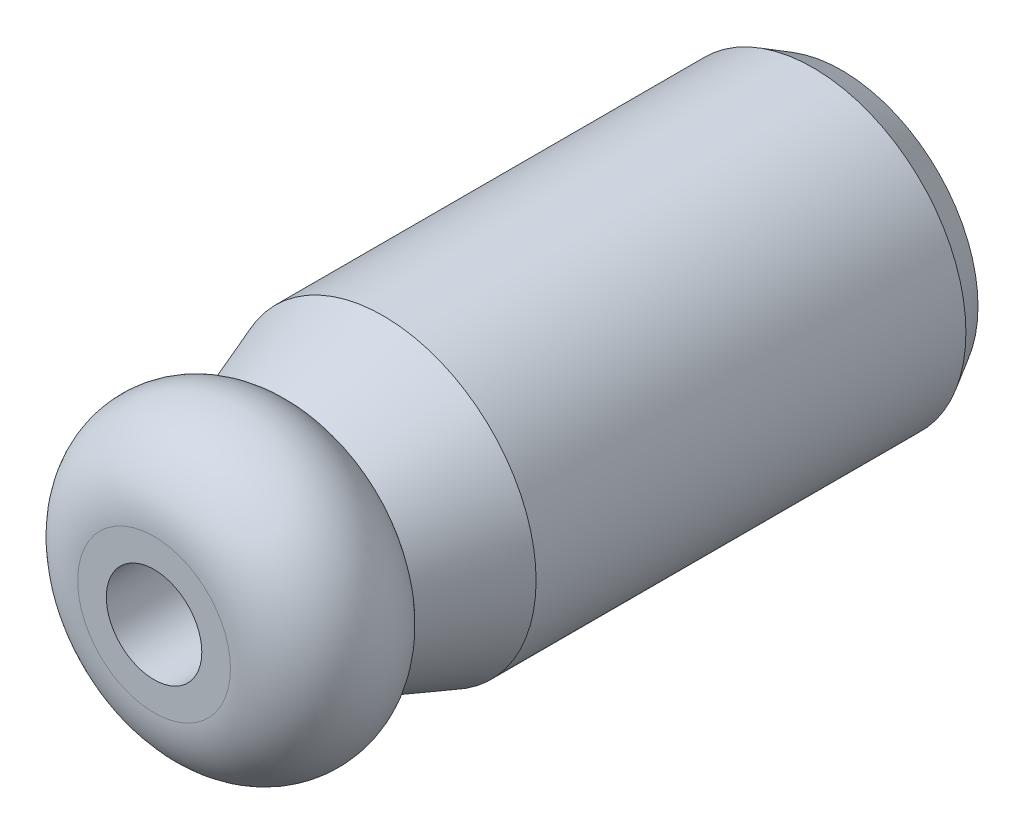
ISO-10303-21;
HEADER;
FILE_DESCRIPTION(('STEP AP214'),'2;1');
FILE_NAME('part.step','',(''),(''),'','','');
FILE_SCHEMA(('AUTOMOTIVE_DESIGN { 1 0 10303 214 1 1 1 1 }'));
ENDSEC;
DATA;
#1=APPLICATION_CONTEXT('core data for automotive mechanical design processes');
#2=APPLICATION_PROTOCOL_DEFINITION('international standard','automotive_design',2000,#1);
#3=PRODUCT_CONTEXT('',#1,'mechanical');
#4=PRODUCT('Part','Part','',(#3));
#5=PRODUCT_RELATED_PRODUCT_CATEGORY('part','',(#4));
#6=PRODUCT_DEFINITION_FORMATION('','',#4);
#7=PRODUCT_DEFINITION_CONTEXT('part definition',#1,'design');
#8=PRODUCT_DEFINITION('design','',#6,#7);
#9=PRODUCT_DEFINITION_SHAPE('','',#8);
#10=(LENGTH_UNIT() NAMED_UNIT(*) SI_UNIT(.MILLI.,.METRE.));
#11=(NAMED_UNIT(*) PLANE_ANGLE_UNIT() SI_UNIT($,.RADIAN.));
#12=(NAMED_UNIT(*) SI_UNIT($,.STERADIAN.) SOLID_ANGLE_UNIT());
#13=UNCERTAINTY_MEASURE_WITH_UNIT(LENGTH_MEASURE(1.E-05),#10,'distance_accuracy_value','');
#14=(GEOMETRIC_REPRESENTATION_CONTEXT(3) GLOBAL_UNCERTAINTY_ASSIGNED_CONTEXT((#13)) GLOBAL_UNIT_ASSIGNED_CONTEXT((#10,
#11,#12)) REPRESENTATION_CONTEXT('',''));
#15=CARTESIAN_POINT('',(0.,0.,0.));
#16=DIRECTION('',(0.,0.,1.));
#17=DIRECTION('',(1.,0.,0.));
#18=AXIS2_PLACEMENT_3D('',#15,#16,#17);
#19=CARTESIAN_POINT('',(0.,2.5,26.));
#20=DIRECTION('',(0.,0.,1.));
#21=DIRECTION('',(1.,0.,0.));
#22=AXIS2_PLACEMENT_3D('',#19,#20,#21);
#23=PLANE('',#22);
#24=CARTESIAN_POINT('',(0.,0.,26.));
#25=DIRECTION('',(0.,0.,1.));
#26=DIRECTION('',(1.,0.,0.));
#27=AXIS2_PLACEMENT_3D('',#24,#25,#26);
#28=CIRCLE('',#27,2.5);
#29=CARTESIAN_POINT('',(2.5,0.,26.));
#30=VERTEX_POINT('',#29);
#31=EDGE_CURVE('E8',#30,#30,#28,.T.);
#32=ORIENTED_EDGE('',*,*,#31,.T.);
#33=EDGE_LOOP('',(#32));
#34=FACE_BOUND('',#33,.T.);
#35=ADVANCED_FACE('F12',(#34),#23,.T.);
#36=CARTESIAN_POINT('',(0.,0.,41.6972645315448));
#37=DIRECTION('',(0.,0.,1.));
#38=DIRECTION('',(1.,0.,0.));
#39=AXIS2_PLACEMENT_3D('',#36,#37,#38);
#40=CYLINDRICAL_SURFACE('',#39,2.5);
#41=CARTESIAN_POINT('',(0.,0.,36.));
#42=DIRECTION('',(0.,0.,1.));
#43=DIRECTION('',(1.,0.,0.));
#44=AXIS2_PLACEMENT_3D('',#41,#42,#43);
#45=CIRCLE('',#44,2.5);
#46=CARTESIAN_POINT('',(2.5,0.,36.));
#47=VERTEX_POINT('',#46);
#48=EDGE_CURVE('E18',#47,#47,#45,.T.);
#49=ORIENTED_EDGE('',*,*,#48,.T.);
#50=EDGE_LOOP('',(#49));
#51=FACE_BOUND('',#50,.T.);
#52=ORIENTED_EDGE('',*,*,#31,.F.);
#53=EDGE_LOOP('',(#52));
#54=FACE_BOUND('',#53,.T.);
#55=ADVANCED_FACE('F54',(#51,#54),#40,.F.);
#56=CARTESIAN_POINT('',(0.,4.,35.999999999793));
#57=DIRECTION('',(0.,0.,1.));
#58=DIRECTION('',(1.,0.,0.));
#59=AXIS2_PLACEMENT_3D('',#56,#57,#58);
#60=PLANE('',#59);
#61=CARTESIAN_POINT('',(0.,0.,35.9999999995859));
#62=DIRECTION('',(0.,0.,1.));
#63=DIRECTION('',(1.,0.,0.));
#64=AXIS2_PLACEMENT_3D('',#61,#62,#63);
#65=CIRCLE('',#64,4.);
#66=CARTESIAN_POINT('',(4.,0.,35.9999999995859));
#67=VERTEX_POINT('',#66);
#68=EDGE_CURVE('E22',#67,#67,#65,.T.);
#69=ORIENTED_EDGE('',*,*,#68,.T.);
#70=EDGE_LOOP('',(#69));
#71=FACE_BOUND('',#70,.T.);
#72=ORIENTED_EDGE('',*,*,#48,.F.);
#73=EDGE_LOOP('',(#72));
#74=FACE_BOUND('',#73,.T.);
#75=ADVANCED_FACE('F58',(#71,#74),#60,.T.);
#76=CARTESIAN_POINT('',(0.,0.,31.9999999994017));
#77=DIRECTION('',(0.,0.,1.));
#78=DIRECTION('',(1.,0.,0.));
#79=AXIS2_PLACEMENT_3D('',#76,#77,#78);
#80=DEGENERATE_TOROIDAL_SURFACE('',#79,4.,4.00000000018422,.T.);
#81=CARTESIAN_POINT('',(0.,0.,28.71589099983));
#82=DIRECTION('',(0.,0.,1.));
#83=DIRECTION('',(1.,0.,0.));
#84=AXIS2_PLACEMENT_3D('',#81,#82,#83);
#85=CIRCLE('',#84,6.2835560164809);
#86=CARTESIAN_POINT('',(6.2835560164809,0.,28.71589099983));
#87=VERTEX_POINT('',#86);
#88=EDGE_CURVE('E26',#87,#87,#85,.T.);
#89=ORIENTED_EDGE('',*,*,#88,.T.);
#90=EDGE_LOOP('',(#89));
#91=FACE_BOUND('',#90,.T.);
#92=ORIENTED_EDGE('',*,*,#68,.F.);
#93=EDGE_LOOP('',(#92));
#94=FACE_BOUND('',#93,.T.);
#95=ADVANCED_FACE('F62',(#91,#94),#80,.T.);
#96=CARTESIAN_POINT('',(0.,0.,28.71589099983));
#97=DIRECTION('',(0.,0.,-1.));
#98=DIRECTION('',(-1.,0.,0.));
#99=AXIS2_PLACEMENT_3D('',#96,#97,#98);
#100=CONICAL_SURFACE('',#99,6.2835560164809,0.349065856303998);
#101=CARTESIAN_POINT('',(0.,0.,24.));
#102=DIRECTION('',(0.,0.,1.));
#103=DIRECTION('',(1.,0.,0.));
#104=AXIS2_PLACEMENT_3D('',#101,#102,#103);
#105=CIRCLE('',#104,8.);
#106=CARTESIAN_POINT('',(8.,0.,24.));
#107=VERTEX_POINT('',#106);
#108=EDGE_CURVE('E31',#107,#107,#105,.T.);
#109=ORIENTED_EDGE('',*,*,#108,.T.);
#110=EDGE_LOOP('',(#109));
#111=FACE_BOUND('',#110,.T.);
#112=ORIENTED_EDGE('',*,*,#88,.F.);
#113=EDGE_LOOP('',(#112));
#114=FACE_BOUND('',#113,.T.);
#115=ADVANCED_FACE('F69',(#111,#114),#100,.T.);
#116=CARTESIAN_POINT('',(0.,0.,41.6972645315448));
#117=DIRECTION('',(0.,0.,1.));
#118=DIRECTION('',(1.,0.,0.));
#119=AXIS2_PLACEMENT_3D('',#116,#117,#118);
#120=CYLINDRICAL_SURFACE('',#119,8.);
#121=CARTESIAN_POINT('',(0.,0.,1.5));
#122=DIRECTION('',(0.,0.,1.));
#123=DIRECTION('',(1.,0.,0.));
#124=AXIS2_PLACEMENT_3D('',#121,#122,#123);
#125=CIRCLE('',#124,8.);
#126=CARTESIAN_POINT('',(8.,0.,1.5));
#127=VERTEX_POINT('',#126);
#128=EDGE_CURVE('E34',#127,#127,#125,.T.);
#129=ORIENTED_EDGE('',*,*,#128,.T.);
#130=EDGE_LOOP('',(#129));
#131=FACE_BOUND('',#130,.T.);
#132=ORIENTED_EDGE('',*,*,#108,.F.);
#133=EDGE_LOOP('',(#132));
#134=FACE_BOUND('',#133,.T.);
#135=ADVANCED_FACE('F51',(#131,#134),#120,.T.);
#136=CARTESIAN_POINT('',(0.,0.,1.5));
#137=DIRECTION('',(0.,0.,1.));
#138=DIRECTION('',(1.,0.,0.));
#139=AXIS2_PLACEMENT_3D('',#136,#137,#138);
#140=CONICAL_SURFACE('',#139,8.,0.523598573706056);
#141=CARTESIAN_POINT('',(0.,0.,0.));
#142=DIRECTION('',(0.,0.,1.));
#143=DIRECTION('',(1.,0.,0.));
#144=AXIS2_PLACEMENT_3D('',#141,#142,#143);
#145=CIRCLE('',#144,7.133975);
#146=CARTESIAN_POINT('',(7.133975,0.,0.));
#147=VERTEX_POINT('',#146);
#148=EDGE_CURVE('E37',#147,#147,#145,.T.);
#149=ORIENTED_EDGE('',*,*,#148,.T.);
#150=EDGE_LOOP('',(#149));
#151=FACE_BOUND('',#150,.T.);
#152=ORIENTED_EDGE('',*,*,#128,.F.);
#153=EDGE_LOOP('',(#152));
#154=FACE_BOUND('',#153,.T.);
#155=ADVANCED_FACE('F41',(#151,#154),#140,.T.);
#156=CARTESIAN_POINT('',(0.,0.,0.));
#157=DIRECTION('',(0.,0.,-1.));
#158=DIRECTION('',(-1.,0.,0.));
#159=AXIS2_PLACEMENT_3D('',#156,#157,#158);
#160=PLANE('',#159);
#161=ORIENTED_EDGE('',*,*,#148,.F.);
#162=EDGE_LOOP('',(#161));
#163=FACE_BOUND('',#162,.T.);
#164=ADVANCED_FACE('F44',(#163),#160,.T.);
#165=CLOSED_SHELL('',(#35,#55,#75,#95,#115,#135,#155,#164));
#166=MANIFOLD_SOLID_BREP('B1',#165);
#167=ADVANCED_BREP_SHAPE_REPRESENTATION('',(#18,#166),#14);
#168=SHAPE_DEFINITION_REPRESENTATION(#9,#167);
ENDSEC;
END-ISO-10303-21;
